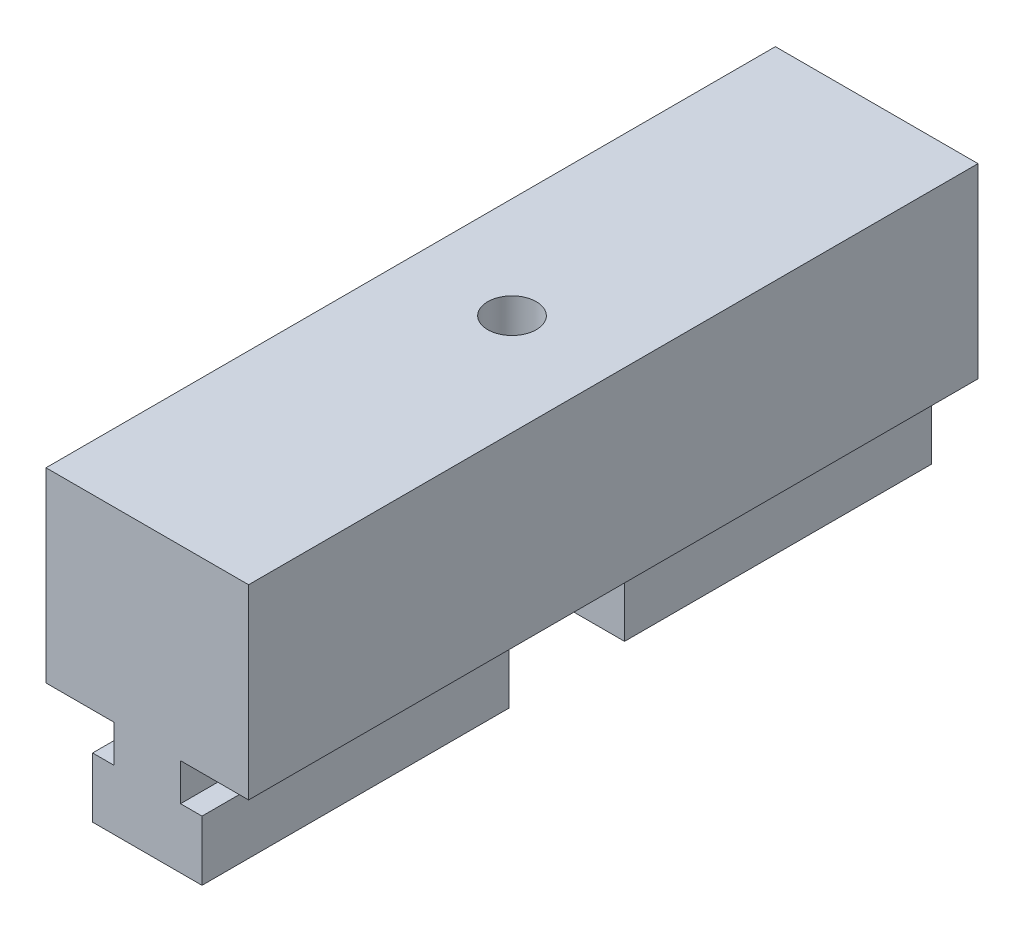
ISO-10303-21;
HEADER;
FILE_DESCRIPTION(('STEP AP214'),'2;1');
FILE_NAME('part.step','',(''),(''),'','','');
FILE_SCHEMA(('AUTOMOTIVE_DESIGN { 1 0 10303 214 1 1 1 1 }'));
ENDSEC;
DATA;
#1=APPLICATION_CONTEXT('core data for automotive mechanical design processes');
#2=APPLICATION_PROTOCOL_DEFINITION('international standard','automotive_design',2000,#1);
#3=PRODUCT_CONTEXT('',#1,'mechanical');
#4=PRODUCT('Part','Part','',(#3));
#5=PRODUCT_RELATED_PRODUCT_CATEGORY('part','',(#4));
#6=PRODUCT_DEFINITION_FORMATION('','',#4);
#7=PRODUCT_DEFINITION_CONTEXT('part definition',#1,'design');
#8=PRODUCT_DEFINITION('design','',#6,#7);
#9=PRODUCT_DEFINITION_SHAPE('','',#8);
#10=(LENGTH_UNIT() NAMED_UNIT(*) SI_UNIT(.MILLI.,.METRE.));
#11=(NAMED_UNIT(*) PLANE_ANGLE_UNIT() SI_UNIT($,.RADIAN.));
#12=(NAMED_UNIT(*) SI_UNIT($,.STERADIAN.) SOLID_ANGLE_UNIT());
#13=UNCERTAINTY_MEASURE_WITH_UNIT(LENGTH_MEASURE(1.E-05),#10,'distance_accuracy_value','');
#14=(GEOMETRIC_REPRESENTATION_CONTEXT(3) GLOBAL_UNCERTAINTY_ASSIGNED_CONTEXT((#13)) GLOBAL_UNIT_ASSIGNED_CONTEXT((#10,
#11,#12)) REPRESENTATION_CONTEXT('',''));
#15=CARTESIAN_POINT('',(0.,0.,0.));
#16=DIRECTION('',(0.,0.,1.));
#17=DIRECTION('',(1.,0.,0.));
#18=AXIS2_PLACEMENT_3D('',#15,#16,#17);
#19=CARTESIAN_POINT('',(-4.10000610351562,-4.5999984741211,-45.));
#20=DIRECTION('',(0.,1.,0.));
#21=DIRECTION('',(0.,0.,1.));
#22=AXIS2_PLACEMENT_3D('',#19,#20,#21);
#23=PLANE('',#22);
#24=DIRECTION('',(0.,0.,1.));
#25=VECTOR('',#24,1.);
#26=CARTESIAN_POINT('',(-4.10000610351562,-4.5999984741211,-45.));
#27=LINE('',#26,#25);
#28=CARTESIAN_POINT('',(-4.10000610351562,-4.5999984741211,7.1375));
#29=VERTEX_POINT('',#28);
#30=CARTESIAN_POINT('',(-4.10000610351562,-4.5999984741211,45.));
#31=VERTEX_POINT('',#30);
#32=EDGE_CURVE('E282',#29,#31,#27,.T.);
#33=ORIENTED_EDGE('',*,*,#32,.F.);
#34=DIRECTION('',(-1.,0.,0.));
#35=VECTOR('',#34,1.);
#36=CARTESIAN_POINT('',(-4.10000610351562,-4.5999984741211,7.1375));
#37=LINE('',#36,#35);
#38=CARTESIAN_POINT('',(-6.75,-4.5999984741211,7.1375));
#39=VERTEX_POINT('',#38);
#40=EDGE_CURVE('E353',#29,#39,#37,.T.);
#41=ORIENTED_EDGE('',*,*,#40,.T.);
#42=DIRECTION('',(0.,0.,1.));
#43=VECTOR('',#42,1.);
#44=CARTESIAN_POINT('',(-6.75,-4.5999984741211,-45.));
#45=LINE('',#44,#43);
#46=CARTESIAN_POINT('',(-6.75,-4.5999984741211,45.));
#47=VERTEX_POINT('',#46);
#48=EDGE_CURVE('E197',#39,#47,#45,.T.);
#49=ORIENTED_EDGE('',*,*,#48,.T.);
#50=DIRECTION('',(-1.,0.,0.));
#51=VECTOR('',#50,1.);
#52=CARTESIAN_POINT('',(-4.10000610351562,-4.5999984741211,45.));
#53=LINE('',#52,#51);
#54=EDGE_CURVE('E222',#31,#47,#53,.T.);
#55=ORIENTED_EDGE('',*,*,#54,.F.);
#56=EDGE_LOOP('',(#33,#41,#49,#55));
#57=FACE_BOUND('',#56,.T.);
#58=ADVANCED_FACE('F32',(#57),#23,.T.);
#59=CARTESIAN_POINT('',(-4.10000610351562,0.,-45.));
#60=DIRECTION('',(-1.,0.,0.));
#61=DIRECTION('',(0.,0.,1.));
#62=AXIS2_PLACEMENT_3D('',#59,#60,#61);
#63=PLANE('',#62);
#64=DIRECTION('',(0.,0.,1.));
#65=VECTOR('',#64,1.);
#66=CARTESIAN_POINT('',(-4.10000610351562,-4.38000000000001,-45.));
#67=LINE('',#66,#65);
#68=CARTESIAN_POINT('',(-4.10000610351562,-4.38000000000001,-7.1375));
#69=VERTEX_POINT('',#68);
#70=CARTESIAN_POINT('',(-4.10000610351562,-4.38000000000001,7.1375));
#71=VERTEX_POINT('',#70);
#72=EDGE_CURVE('E352',#69,#71,#67,.T.);
#73=ORIENTED_EDGE('',*,*,#72,.T.);
#74=DIRECTION('',(0.,-1.,0.));
#75=VECTOR('',#74,1.);
#76=CARTESIAN_POINT('',(-4.10000610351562,0.,7.1375));
#77=LINE('',#76,#75);
#78=EDGE_CURVE('E357',#71,#29,#77,.T.);
#79=ORIENTED_EDGE('',*,*,#78,.T.);
#80=ORIENTED_EDGE('',*,*,#32,.T.);
#81=DIRECTION('',(0.,-1.,0.));
#82=VECTOR('',#81,1.);
#83=CARTESIAN_POINT('',(-4.10000610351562,0.,45.));
#84=LINE('',#83,#82);
#85=CARTESIAN_POINT('',(-4.10000610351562,0.,45.));
#86=VERTEX_POINT('',#85);
#87=EDGE_CURVE('E246',#86,#31,#84,.T.);
#88=ORIENTED_EDGE('',*,*,#87,.F.);
#89=DIRECTION('',(0.,0.,1.));
#90=VECTOR('',#89,1.);
#91=CARTESIAN_POINT('',(-4.10000610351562,0.,-45.));
#92=LINE('',#91,#90);
#93=CARTESIAN_POINT('',(-4.10000610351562,0.,-45.));
#94=VERTEX_POINT('',#93);
#95=EDGE_CURVE('E283',#94,#86,#92,.T.);
#96=ORIENTED_EDGE('',*,*,#95,.F.);
#97=DIRECTION('',(0.,-1.,0.));
#98=VECTOR('',#97,1.);
#99=CARTESIAN_POINT('',(-4.10000610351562,0.,-45.));
#100=LINE('',#99,#98);
#101=CARTESIAN_POINT('',(-4.10000610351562,-4.5999984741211,-45.));
#102=VERTEX_POINT('',#101);
#103=EDGE_CURVE('E278',#94,#102,#100,.T.);
#104=ORIENTED_EDGE('',*,*,#103,.T.);
#105=CARTESIAN_POINT('',(-4.10000610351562,-4.5999984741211,-7.1375));
#106=VERTEX_POINT('',#105);
#107=EDGE_CURVE('E54',#102,#106,#27,.T.);
#108=ORIENTED_EDGE('',*,*,#107,.T.);
#109=DIRECTION('',(0.,-1.,0.));
#110=VECTOR('',#109,1.);
#111=CARTESIAN_POINT('',(-4.10000610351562,0.,-7.1375));
#112=LINE('',#111,#110);
#113=EDGE_CURVE('E363',#69,#106,#112,.T.);
#114=ORIENTED_EDGE('',*,*,#113,.F.);
#115=EDGE_LOOP('',(#73,#79,#80,#88,#96,#104,#108,#114));
#116=FACE_BOUND('',#115,.T.);
#117=ADVANCED_FACE('F346',(#116),#63,.T.);
#118=CARTESIAN_POINT('',(4.10000610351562,-4.5999984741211,-45.));
#119=DIRECTION('',(1.,0.,0.));
#120=DIRECTION('',(0.,1.,0.));
#121=AXIS2_PLACEMENT_3D('',#118,#119,#120);
#122=PLANE('',#121);
#123=DIRECTION('',(0.,0.,1.));
#124=VECTOR('',#123,1.);
#125=CARTESIAN_POINT('',(4.10000610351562,-4.5999984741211,-45.));
#126=LINE('',#125,#124);
#127=CARTESIAN_POINT('',(4.10000610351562,-4.5999984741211,7.1375));
#128=VERTEX_POINT('',#127);
#129=CARTESIAN_POINT('',(4.10000610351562,-4.5999984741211,45.));
#130=VERTEX_POINT('',#129);
#131=EDGE_CURVE('E297',#128,#130,#126,.T.);
#132=ORIENTED_EDGE('',*,*,#131,.F.);
#133=DIRECTION('',(0.,1.,0.));
#134=VECTOR('',#133,1.);
#135=CARTESIAN_POINT('',(4.10000610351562,-4.5999984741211,7.1375));
#136=LINE('',#135,#134);
#137=CARTESIAN_POINT('',(4.10000610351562,-4.38000000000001,7.1375));
#138=VERTEX_POINT('',#137);
#139=EDGE_CURVE('E319',#128,#138,#136,.T.);
#140=ORIENTED_EDGE('',*,*,#139,.T.);
#141=DIRECTION('',(0.,0.,-1.));
#142=VECTOR('',#141,1.);
#143=CARTESIAN_POINT('',(4.10000610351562,-4.38000000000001,-45.));
#144=LINE('',#143,#142);
#145=CARTESIAN_POINT('',(4.10000610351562,-4.38000000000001,-7.1375));
#146=VERTEX_POINT('',#145);
#147=EDGE_CURVE('E11',#138,#146,#144,.T.);
#148=ORIENTED_EDGE('',*,*,#147,.T.);
#149=DIRECTION('',(0.,1.,0.));
#150=VECTOR('',#149,1.);
#151=CARTESIAN_POINT('',(4.10000610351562,-4.5999984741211,-7.1375));
#152=LINE('',#151,#150);
#153=CARTESIAN_POINT('',(4.10000610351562,-4.5999984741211,-7.1375));
#154=VERTEX_POINT('',#153);
#155=EDGE_CURVE('E365',#154,#146,#152,.T.);
#156=ORIENTED_EDGE('',*,*,#155,.F.);
#157=CARTESIAN_POINT('',(4.10000610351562,-4.5999984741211,-45.));
#158=VERTEX_POINT('',#157);
#159=EDGE_CURVE('E295',#158,#154,#126,.T.);
#160=ORIENTED_EDGE('',*,*,#159,.F.);
#161=DIRECTION('',(0.,1.,0.));
#162=VECTOR('',#161,1.);
#163=CARTESIAN_POINT('',(4.10000610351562,-4.5999984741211,-45.));
#164=LINE('',#163,#162);
#165=CARTESIAN_POINT('',(4.10000610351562,0.,-45.));
#166=VERTEX_POINT('',#165);
#167=EDGE_CURVE('E260',#158,#166,#164,.T.);
#168=ORIENTED_EDGE('',*,*,#167,.T.);
#169=DIRECTION('',(0.,0.,1.));
#170=VECTOR('',#169,1.);
#171=CARTESIAN_POINT('',(4.10000610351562,0.,-45.));
#172=LINE('',#171,#170);
#173=CARTESIAN_POINT('',(4.10000610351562,0.,45.));
#174=VERTEX_POINT('',#173);
#175=EDGE_CURVE('E293',#166,#174,#172,.T.);
#176=ORIENTED_EDGE('',*,*,#175,.T.);
#177=DIRECTION('',(0.,1.,0.));
#178=VECTOR('',#177,1.);
#179=CARTESIAN_POINT('',(4.10000610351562,-4.5999984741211,45.));
#180=LINE('',#179,#178);
#181=EDGE_CURVE('E228',#130,#174,#180,.T.);
#182=ORIENTED_EDGE('',*,*,#181,.F.);
#183=EDGE_LOOP('',(#132,#140,#148,#156,#160,#168,#176,#182));
#184=FACE_BOUND('',#183,.T.);
#185=ADVANCED_FACE('F318',(#184),#122,.T.);
#186=CARTESIAN_POINT('',(6.75,-4.5999984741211,-45.));
#187=DIRECTION('',(0.,1.,0.));
#188=DIRECTION('',(0.,0.,1.));
#189=AXIS2_PLACEMENT_3D('',#186,#187,#188);
#190=PLANE('',#189);
#191=DIRECTION('',(0.,0.,1.));
#192=VECTOR('',#191,1.);
#193=CARTESIAN_POINT('',(6.75,-4.5999984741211,-45.));
#194=LINE('',#193,#192);
#195=CARTESIAN_POINT('',(6.75,-4.5999984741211,7.1375));
#196=VERTEX_POINT('',#195);
#197=CARTESIAN_POINT('',(6.75,-4.5999984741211,45.));
#198=VERTEX_POINT('',#197);
#199=EDGE_CURVE('E300',#196,#198,#194,.T.);
#200=ORIENTED_EDGE('',*,*,#199,.F.);
#201=DIRECTION('',(-1.,0.,0.));
#202=VECTOR('',#201,1.);
#203=CARTESIAN_POINT('',(6.75,-4.5999984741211,7.1375));
#204=LINE('',#203,#202);
#205=EDGE_CURVE('E315',#196,#128,#204,.T.);
#206=ORIENTED_EDGE('',*,*,#205,.T.);
#207=ORIENTED_EDGE('',*,*,#131,.T.);
#208=DIRECTION('',(-1.,0.,0.));
#209=VECTOR('',#208,1.);
#210=CARTESIAN_POINT('',(6.75,-4.5999984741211,45.));
#211=LINE('',#210,#209);
#212=EDGE_CURVE('E220',#198,#130,#211,.T.);
#213=ORIENTED_EDGE('',*,*,#212,.F.);
#214=EDGE_LOOP('',(#200,#206,#207,#213));
#215=FACE_BOUND('',#214,.T.);
#216=ADVANCED_FACE('F313',(#215),#190,.T.);
#217=CARTESIAN_POINT('',(6.75,-12.,-45.));
#218=DIRECTION('',(1.,0.,0.));
#219=DIRECTION('',(0.,0.,-1.));
#220=AXIS2_PLACEMENT_3D('',#217,#218,#219);
#221=PLANE('',#220);
#222=DIRECTION('',(0.,0.,1.));
#223=VECTOR('',#222,1.);
#224=CARTESIAN_POINT('',(6.75,-12.,-45.));
#225=LINE('',#224,#223);
#226=CARTESIAN_POINT('',(6.75,-12.,7.1375));
#227=VERTEX_POINT('',#226);
#228=CARTESIAN_POINT('',(6.75,-12.,45.));
#229=VERTEX_POINT('',#228);
#230=EDGE_CURVE('E190',#227,#229,#225,.T.);
#231=ORIENTED_EDGE('',*,*,#230,.F.);
#232=DIRECTION('',(0.,-1.,0.));
#233=VECTOR('',#232,1.);
#234=CARTESIAN_POINT('',(6.75,-4.38000000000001,7.1375));
#235=LINE('',#234,#233);
#236=EDGE_CURVE('E306',#196,#227,#235,.T.);
#237=ORIENTED_EDGE('',*,*,#236,.F.);
#238=ORIENTED_EDGE('',*,*,#199,.T.);
#239=DIRECTION('',(0.,1.,0.));
#240=VECTOR('',#239,1.);
#241=CARTESIAN_POINT('',(6.75,-12.,45.));
#242=LINE('',#241,#240);
#243=EDGE_CURVE('E217',#229,#198,#242,.T.);
#244=ORIENTED_EDGE('',*,*,#243,.F.);
#245=EDGE_LOOP('',(#231,#237,#238,#244));
#246=FACE_BOUND('',#245,.T.);
#247=ADVANCED_FACE('F305',(#246),#221,.T.);
#248=CARTESIAN_POINT('',(-6.75,-12.,-45.));
#249=DIRECTION('',(0.,-1.,0.));
#250=DIRECTION('',(0.,0.,-1.));
#251=AXIS2_PLACEMENT_3D('',#248,#249,#250);
#252=PLANE('',#251);
#253=DIRECTION('',(0.,0.,1.));
#254=VECTOR('',#253,1.);
#255=CARTESIAN_POINT('',(-6.75,-12.,-45.));
#256=LINE('',#255,#254);
#257=CARTESIAN_POINT('',(-6.75,-12.,7.1375));
#258=VERTEX_POINT('',#257);
#259=CARTESIAN_POINT('',(-6.75,-12.,45.));
#260=VERTEX_POINT('',#259);
#261=EDGE_CURVE('E191',#258,#260,#256,.T.);
#262=ORIENTED_EDGE('',*,*,#261,.F.);
#263=DIRECTION('',(1.,0.,0.));
#264=VECTOR('',#263,1.);
#265=CARTESIAN_POINT('',(-6.75,-12.,7.1375));
#266=LINE('',#265,#264);
#267=EDGE_CURVE('E183',#258,#227,#266,.T.);
#268=ORIENTED_EDGE('',*,*,#267,.T.);
#269=ORIENTED_EDGE('',*,*,#230,.T.);
#270=DIRECTION('',(1.,0.,0.));
#271=VECTOR('',#270,1.);
#272=CARTESIAN_POINT('',(-6.75,-12.,45.));
#273=LINE('',#272,#271);
#274=EDGE_CURVE('E213',#260,#229,#273,.T.);
#275=ORIENTED_EDGE('',*,*,#274,.F.);
#276=EDGE_LOOP('',(#262,#268,#269,#275));
#277=FACE_BOUND('',#276,.T.);
#278=ADVANCED_FACE('F210',(#277),#252,.T.);
#279=CARTESIAN_POINT('',(-6.75,-4.5999984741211,-45.));
#280=DIRECTION('',(-1.,0.,0.));
#281=DIRECTION('',(0.,0.,1.));
#282=AXIS2_PLACEMENT_3D('',#279,#280,#281);
#283=PLANE('',#282);
#284=ORIENTED_EDGE('',*,*,#48,.F.);
#285=DIRECTION('',(0.,-1.,0.));
#286=VECTOR('',#285,1.);
#287=CARTESIAN_POINT('',(-6.75,-4.5999984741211,7.1375));
#288=LINE('',#287,#286);
#289=EDGE_CURVE('E40',#39,#258,#288,.T.);
#290=ORIENTED_EDGE('',*,*,#289,.T.);
#291=ORIENTED_EDGE('',*,*,#261,.T.);
#292=DIRECTION('',(0.,-1.,0.));
#293=VECTOR('',#292,1.);
#294=CARTESIAN_POINT('',(-6.75,-4.5999984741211,45.));
#295=LINE('',#294,#293);
#296=EDGE_CURVE('E218',#47,#260,#295,.T.);
#297=ORIENTED_EDGE('',*,*,#296,.F.);
#298=EDGE_LOOP('',(#284,#290,#291,#297));
#299=FACE_BOUND('',#298,.T.);
#300=ADVANCED_FACE('F202',(#299),#283,.T.);
#301=DIRECTION('',(-1.,0.,0.));
#302=VECTOR('',#301,1.);
#303=CARTESIAN_POINT('',(-4.10000610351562,-4.5999984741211,-7.1375));
#304=LINE('',#303,#302);
#305=CARTESIAN_POINT('',(-6.75,-4.5999984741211,-7.13750000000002));
#306=VERTEX_POINT('',#305);
#307=EDGE_CURVE('E47',#106,#306,#304,.T.);
#308=ORIENTED_EDGE('',*,*,#307,.F.);
#309=ORIENTED_EDGE('',*,*,#107,.F.);
#310=DIRECTION('',(-1.,0.,0.));
#311=VECTOR('',#310,1.);
#312=CARTESIAN_POINT('',(-4.10000610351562,-4.5999984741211,-45.));
#313=LINE('',#312,#311);
#314=CARTESIAN_POINT('',(-6.75,-4.5999984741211,-45.));
#315=VERTEX_POINT('',#314);
#316=EDGE_CURVE('E249',#102,#315,#313,.T.);
#317=ORIENTED_EDGE('',*,*,#316,.T.);
#318=EDGE_CURVE('E194',#315,#306,#45,.T.);
#319=ORIENTED_EDGE('',*,*,#318,.T.);
#320=EDGE_LOOP('',(#308,#309,#317,#319));
#321=FACE_BOUND('',#320,.T.);
#322=ADVANCED_FACE('F34',(#321),#23,.T.);
#323=CARTESIAN_POINT('',(-12.5,0.,-45.));
#324=DIRECTION('',(0.,-1.,0.));
#325=DIRECTION('',(1.,0.,0.));
#326=AXIS2_PLACEMENT_3D('',#323,#324,#325);
#327=PLANE('',#326);
#328=ORIENTED_EDGE('',*,*,#95,.T.);
#329=DIRECTION('',(1.,0.,0.));
#330=VECTOR('',#329,1.);
#331=CARTESIAN_POINT('',(-12.5,0.,45.));
#332=LINE('',#331,#330);
#333=CARTESIAN_POINT('',(-12.5,0.,45.));
#334=VERTEX_POINT('',#333);
#335=EDGE_CURVE('E243',#334,#86,#332,.T.);
#336=ORIENTED_EDGE('',*,*,#335,.F.);
#337=DIRECTION('',(0.,0.,1.));
#338=VECTOR('',#337,1.);
#339=CARTESIAN_POINT('',(-12.5,0.,-45.));
#340=LINE('',#339,#338);
#341=CARTESIAN_POINT('',(-12.5,0.,-45.));
#342=VERTEX_POINT('',#341);
#343=EDGE_CURVE('E285',#342,#334,#340,.T.);
#344=ORIENTED_EDGE('',*,*,#343,.F.);
#345=DIRECTION('',(1.,0.,0.));
#346=VECTOR('',#345,1.);
#347=CARTESIAN_POINT('',(-12.5,0.,-45.));
#348=LINE('',#347,#346);
#349=EDGE_CURVE('E275',#342,#94,#348,.T.);
#350=ORIENTED_EDGE('',*,*,#349,.T.);
#351=EDGE_LOOP('',(#328,#336,#344,#350));
#352=FACE_BOUND('',#351,.T.);
#353=ADVANCED_FACE('F342',(#352),#327,.T.);
#354=CARTESIAN_POINT('',(-12.5,22.9999923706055,-45.));
#355=DIRECTION('',(-1.,0.,0.));
#356=DIRECTION('',(0.,-1.,0.));
#357=AXIS2_PLACEMENT_3D('',#354,#355,#356);
#358=PLANE('',#357);
#359=ORIENTED_EDGE('',*,*,#343,.T.);
#360=DIRECTION('',(0.,-1.,0.));
#361=VECTOR('',#360,1.);
#362=CARTESIAN_POINT('',(-12.5,22.9999923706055,45.));
#363=LINE('',#362,#361);
#364=CARTESIAN_POINT('',(-12.5,22.9999923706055,45.));
#365=VERTEX_POINT('',#364);
#366=EDGE_CURVE('E240',#365,#334,#363,.T.);
#367=ORIENTED_EDGE('',*,*,#366,.F.);
#368=DIRECTION('',(0.,0.,1.));
#369=VECTOR('',#368,1.);
#370=CARTESIAN_POINT('',(-12.5,22.9999923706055,-45.));
#371=LINE('',#370,#369);
#372=CARTESIAN_POINT('',(-12.5,22.9999923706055,-45.));
#373=VERTEX_POINT('',#372);
#374=EDGE_CURVE('E287',#373,#365,#371,.T.);
#375=ORIENTED_EDGE('',*,*,#374,.F.);
#376=DIRECTION('',(0.,-1.,0.));
#377=VECTOR('',#376,1.);
#378=CARTESIAN_POINT('',(-12.5,22.9999923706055,-45.));
#379=LINE('',#378,#377);
#380=EDGE_CURVE('E272',#373,#342,#379,.T.);
#381=ORIENTED_EDGE('',*,*,#380,.T.);
#382=EDGE_LOOP('',(#359,#367,#375,#381));
#383=FACE_BOUND('',#382,.T.);
#384=ADVANCED_FACE('F340',(#383),#358,.T.);
#385=CARTESIAN_POINT('',(12.5,22.9999923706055,-45.));
#386=DIRECTION('',(0.,1.,0.));
#387=DIRECTION('',(0.,0.,1.));
#388=AXIS2_PLACEMENT_3D('',#385,#386,#387);
#389=PLANE('',#388);
#390=CARTESIAN_POINT('',(0.,22.9999923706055,0.));
#391=DIRECTION('',(0.,-1.,0.));
#392=DIRECTION('',(0.,0.,-1.));
#393=AXIS2_PLACEMENT_3D('',#390,#391,#392);
#394=CIRCLE('',#393,3.);
#395=CARTESIAN_POINT('',(0.,22.9999923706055,-3.));
#396=VERTEX_POINT('',#395);
#397=EDGE_CURVE('E184',#396,#396,#394,.T.);
#398=ORIENTED_EDGE('',*,*,#397,.T.);
#399=EDGE_LOOP('',(#398));
#400=FACE_BOUND('',#399,.T.);
#401=ORIENTED_EDGE('',*,*,#374,.T.);
#402=DIRECTION('',(-1.,0.,0.));
#403=VECTOR('',#402,1.);
#404=CARTESIAN_POINT('',(12.5,22.9999923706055,45.));
#405=LINE('',#404,#403);
#406=CARTESIAN_POINT('',(12.5,22.9999923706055,45.));
#407=VERTEX_POINT('',#406);
#408=EDGE_CURVE('E237',#407,#365,#405,.T.);
#409=ORIENTED_EDGE('',*,*,#408,.F.);
#410=DIRECTION('',(0.,0.,1.));
#411=VECTOR('',#410,1.);
#412=CARTESIAN_POINT('',(12.5,22.9999923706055,-45.));
#413=LINE('',#412,#411);
#414=CARTESIAN_POINT('',(12.5,22.9999923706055,-45.));
#415=VERTEX_POINT('',#414);
#416=EDGE_CURVE('E289',#415,#407,#413,.T.);
#417=ORIENTED_EDGE('',*,*,#416,.F.);
#418=DIRECTION('',(-1.,0.,0.));
#419=VECTOR('',#418,1.);
#420=CARTESIAN_POINT('',(12.5,22.9999923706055,-45.));
#421=LINE('',#420,#419);
#422=EDGE_CURVE('E269',#415,#373,#421,.T.);
#423=ORIENTED_EDGE('',*,*,#422,.T.);
#424=EDGE_LOOP('',(#401,#409,#417,#423));
#425=FACE_BOUND('',#424,.T.);
#426=ADVANCED_FACE('F335',(#400,#425),#389,.T.);
#427=CARTESIAN_POINT('',(12.5,0.,-45.));
#428=DIRECTION('',(1.,0.,0.));
#429=DIRECTION('',(0.,0.,-1.));
#430=AXIS2_PLACEMENT_3D('',#427,#428,#429);
#431=PLANE('',#430);
#432=ORIENTED_EDGE('',*,*,#416,.T.);
#433=DIRECTION('',(0.,1.,0.));
#434=VECTOR('',#433,1.);
#435=CARTESIAN_POINT('',(12.5,0.,45.));
#436=LINE('',#435,#434);
#437=CARTESIAN_POINT('',(12.5,0.,45.));
#438=VERTEX_POINT('',#437);
#439=EDGE_CURVE('E234',#438,#407,#436,.T.);
#440=ORIENTED_EDGE('',*,*,#439,.F.);
#441=DIRECTION('',(0.,0.,1.));
#442=VECTOR('',#441,1.);
#443=CARTESIAN_POINT('',(12.5,0.,-45.));
#444=LINE('',#443,#442);
#445=CARTESIAN_POINT('',(12.5,0.,-45.));
#446=VERTEX_POINT('',#445);
#447=EDGE_CURVE('E291',#446,#438,#444,.T.);
#448=ORIENTED_EDGE('',*,*,#447,.F.);
#449=DIRECTION('',(0.,1.,0.));
#450=VECTOR('',#449,1.);
#451=CARTESIAN_POINT('',(12.5,0.,-45.));
#452=LINE('',#451,#450);
#453=EDGE_CURVE('E266',#446,#415,#452,.T.);
#454=ORIENTED_EDGE('',*,*,#453,.T.);
#455=EDGE_LOOP('',(#432,#440,#448,#454));
#456=FACE_BOUND('',#455,.T.);
#457=ADVANCED_FACE('F327',(#456),#431,.T.);
#458=CARTESIAN_POINT('',(4.10000610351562,0.,-45.));
#459=DIRECTION('',(0.,-1.,0.));
#460=DIRECTION('',(1.,0.,0.));
#461=AXIS2_PLACEMENT_3D('',#458,#459,#460);
#462=PLANE('',#461);
#463=ORIENTED_EDGE('',*,*,#447,.T.);
#464=DIRECTION('',(1.,0.,0.));
#465=VECTOR('',#464,1.);
#466=CARTESIAN_POINT('',(4.10000610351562,0.,45.));
#467=LINE('',#466,#465);
#468=EDGE_CURVE('E231',#174,#438,#467,.T.);
#469=ORIENTED_EDGE('',*,*,#468,.F.);
#470=ORIENTED_EDGE('',*,*,#175,.F.);
#471=DIRECTION('',(1.,0.,0.));
#472=VECTOR('',#471,1.);
#473=CARTESIAN_POINT('',(4.10000610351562,0.,-45.));
#474=LINE('',#473,#472);
#475=EDGE_CURVE('E263',#166,#446,#474,.T.);
#476=ORIENTED_EDGE('',*,*,#475,.T.);
#477=EDGE_LOOP('',(#463,#469,#470,#476));
#478=FACE_BOUND('',#477,.T.);
#479=ADVANCED_FACE('F323',(#478),#462,.T.);
#480=DIRECTION('',(-1.,0.,0.));
#481=VECTOR('',#480,1.);
#482=CARTESIAN_POINT('',(6.75,-4.5999984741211,-7.1375));
#483=LINE('',#482,#481);
#484=CARTESIAN_POINT('',(6.75,-4.5999984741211,-7.1375));
#485=VERTEX_POINT('',#484);
#486=EDGE_CURVE('E367',#485,#154,#483,.T.);
#487=ORIENTED_EDGE('',*,*,#486,.F.);
#488=CARTESIAN_POINT('',(6.75,-4.5999984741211,-45.));
#489=VERTEX_POINT('',#488);
#490=EDGE_CURVE('E298',#489,#485,#194,.T.);
#491=ORIENTED_EDGE('',*,*,#490,.F.);
#492=DIRECTION('',(-1.,0.,0.));
#493=VECTOR('',#492,1.);
#494=CARTESIAN_POINT('',(6.75,-4.5999984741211,-45.));
#495=LINE('',#494,#493);
#496=EDGE_CURVE('E257',#489,#158,#495,.T.);
#497=ORIENTED_EDGE('',*,*,#496,.T.);
#498=ORIENTED_EDGE('',*,*,#159,.T.);
#499=EDGE_LOOP('',(#487,#491,#497,#498));
#500=FACE_BOUND('',#499,.T.);
#501=ADVANCED_FACE('F401',(#500),#190,.T.);
#502=DIRECTION('',(0.,-1.,0.));
#503=VECTOR('',#502,1.);
#504=CARTESIAN_POINT('',(6.75,-4.38000000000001,-7.1375));
#505=LINE('',#504,#503);
#506=CARTESIAN_POINT('',(6.75,-12.,-7.1375));
#507=VERTEX_POINT('',#506);
#508=EDGE_CURVE('E369',#485,#507,#505,.T.);
#509=ORIENTED_EDGE('',*,*,#508,.T.);
#510=CARTESIAN_POINT('',(6.75,-12.,-45.));
#511=VERTEX_POINT('',#510);
#512=EDGE_CURVE('E182',#511,#507,#225,.T.);
#513=ORIENTED_EDGE('',*,*,#512,.F.);
#514=DIRECTION('',(0.,1.,0.));
#515=VECTOR('',#514,1.);
#516=CARTESIAN_POINT('',(6.75,-12.,-45.));
#517=LINE('',#516,#515);
#518=EDGE_CURVE('E254',#511,#489,#517,.T.);
#519=ORIENTED_EDGE('',*,*,#518,.T.);
#520=ORIENTED_EDGE('',*,*,#490,.T.);
#521=EDGE_LOOP('',(#509,#513,#519,#520));
#522=FACE_BOUND('',#521,.T.);
#523=ADVANCED_FACE('F404',(#522),#221,.T.);
#524=DIRECTION('',(1.,0.,0.));
#525=VECTOR('',#524,1.);
#526=CARTESIAN_POINT('',(-6.75,-12.,-7.1375));
#527=LINE('',#526,#525);
#528=CARTESIAN_POINT('',(-6.75,-12.,-7.1375));
#529=VERTEX_POINT('',#528);
#530=EDGE_CURVE('E170',#529,#507,#527,.T.);
#531=ORIENTED_EDGE('',*,*,#530,.F.);
#532=CARTESIAN_POINT('',(-6.75,-12.,-45.));
#533=VERTEX_POINT('',#532);
#534=EDGE_CURVE('E180',#533,#529,#256,.T.);
#535=ORIENTED_EDGE('',*,*,#534,.F.);
#536=DIRECTION('',(1.,0.,0.));
#537=VECTOR('',#536,1.);
#538=CARTESIAN_POINT('',(-6.75,-12.,-45.));
#539=LINE('',#538,#537);
#540=EDGE_CURVE('E252',#533,#511,#539,.T.);
#541=ORIENTED_EDGE('',*,*,#540,.T.);
#542=ORIENTED_EDGE('',*,*,#512,.T.);
#543=EDGE_LOOP('',(#531,#535,#541,#542));
#544=FACE_BOUND('',#543,.T.);
#545=ADVANCED_FACE('F178',(#544),#252,.T.);
#546=DIRECTION('',(0.,-1.,0.));
#547=VECTOR('',#546,1.);
#548=CARTESIAN_POINT('',(-6.75,-4.5999984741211,-7.1375));
#549=LINE('',#548,#547);
#550=EDGE_CURVE('E167',#306,#529,#549,.T.);
#551=ORIENTED_EDGE('',*,*,#550,.F.);
#552=ORIENTED_EDGE('',*,*,#318,.F.);
#553=DIRECTION('',(0.,-1.,0.));
#554=VECTOR('',#553,1.);
#555=CARTESIAN_POINT('',(-6.75,-4.5999984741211,-45.));
#556=LINE('',#555,#554);
#557=EDGE_CURVE('E189',#315,#533,#556,.T.);
#558=ORIENTED_EDGE('',*,*,#557,.T.);
#559=ORIENTED_EDGE('',*,*,#534,.T.);
#560=EDGE_LOOP('',(#551,#552,#558,#559));
#561=FACE_BOUND('',#560,.T.);
#562=ADVANCED_FACE('F187',(#561),#283,.T.);
#563=CARTESIAN_POINT('',(-6.75,-4.5999984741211,-45.));
#564=DIRECTION('',(0.,0.,1.));
#565=DIRECTION('',(1.,0.,0.));
#566=AXIS2_PLACEMENT_3D('',#563,#564,#565);
#567=PLANE('',#566);
#568=ORIENTED_EDGE('',*,*,#316,.F.);
#569=ORIENTED_EDGE('',*,*,#103,.F.);
#570=ORIENTED_EDGE('',*,*,#349,.F.);
#571=ORIENTED_EDGE('',*,*,#380,.F.);
#572=ORIENTED_EDGE('',*,*,#422,.F.);
#573=ORIENTED_EDGE('',*,*,#453,.F.);
#574=ORIENTED_EDGE('',*,*,#475,.F.);
#575=ORIENTED_EDGE('',*,*,#167,.F.);
#576=ORIENTED_EDGE('',*,*,#496,.F.);
#577=ORIENTED_EDGE('',*,*,#518,.F.);
#578=ORIENTED_EDGE('',*,*,#540,.F.);
#579=ORIENTED_EDGE('',*,*,#557,.F.);
#580=EDGE_LOOP('',(#568,#569,#570,#571,#572,#573,#574,#575,#576,#577,#578,#579));
#581=FACE_BOUND('',#580,.T.);
#582=ADVANCED_FACE('F330',(#581),#567,.F.);
#583=CARTESIAN_POINT('',(-6.75,-4.5999984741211,45.));
#584=DIRECTION('',(0.,0.,1.));
#585=DIRECTION('',(1.,0.,0.));
#586=AXIS2_PLACEMENT_3D('',#583,#584,#585);
#587=PLANE('',#586);
#588=ORIENTED_EDGE('',*,*,#54,.T.);
#589=ORIENTED_EDGE('',*,*,#296,.T.);
#590=ORIENTED_EDGE('',*,*,#274,.T.);
#591=ORIENTED_EDGE('',*,*,#243,.T.);
#592=ORIENTED_EDGE('',*,*,#212,.T.);
#593=ORIENTED_EDGE('',*,*,#181,.T.);
#594=ORIENTED_EDGE('',*,*,#468,.T.);
#595=ORIENTED_EDGE('',*,*,#439,.T.);
#596=ORIENTED_EDGE('',*,*,#408,.T.);
#597=ORIENTED_EDGE('',*,*,#366,.T.);
#598=ORIENTED_EDGE('',*,*,#335,.T.);
#599=ORIENTED_EDGE('',*,*,#87,.T.);
#600=EDGE_LOOP('',(#588,#589,#590,#591,#592,#593,#594,#595,#596,#597,#598,#599));
#601=FACE_BOUND('',#600,.T.);
#602=ADVANCED_FACE('F311',(#601),#587,.T.);
#603=CARTESIAN_POINT('',(-6.75,-4.38000000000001,7.1375));
#604=DIRECTION('',(0.,0.,-1.));
#605=DIRECTION('',(-1.,0.,0.));
#606=AXIS2_PLACEMENT_3D('',#603,#604,#605);
#607=PLANE('',#606);
#608=ORIENTED_EDGE('',*,*,#78,.F.);
#609=DIRECTION('',(1.,0.,0.));
#610=VECTOR('',#609,1.);
#611=CARTESIAN_POINT('',(-6.75,-4.38000000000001,7.1375));
#612=LINE('',#611,#610);
#613=EDGE_CURVE('E371',#71,#138,#612,.T.);
#614=ORIENTED_EDGE('',*,*,#613,.T.);
#615=ORIENTED_EDGE('',*,*,#139,.F.);
#616=ORIENTED_EDGE('',*,*,#205,.F.);
#617=ORIENTED_EDGE('',*,*,#236,.T.);
#618=ORIENTED_EDGE('',*,*,#267,.F.);
#619=ORIENTED_EDGE('',*,*,#289,.F.);
#620=ORIENTED_EDGE('',*,*,#40,.F.);
#621=EDGE_LOOP('',(#608,#614,#615,#616,#617,#618,#619,#620));
#622=FACE_BOUND('',#621,.T.);
#623=ADVANCED_FACE('F436',(#622),#607,.T.);
#624=CARTESIAN_POINT('',(-6.75,-4.38000000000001,-7.1375));
#625=DIRECTION('',(0.,0.,-1.));
#626=DIRECTION('',(-1.,0.,0.));
#627=AXIS2_PLACEMENT_3D('',#624,#625,#626);
#628=PLANE('',#627);
#629=ORIENTED_EDGE('',*,*,#307,.T.);
#630=ORIENTED_EDGE('',*,*,#550,.T.);
#631=ORIENTED_EDGE('',*,*,#530,.T.);
#632=ORIENTED_EDGE('',*,*,#508,.F.);
#633=ORIENTED_EDGE('',*,*,#486,.T.);
#634=ORIENTED_EDGE('',*,*,#155,.T.);
#635=DIRECTION('',(1.,0.,0.));
#636=VECTOR('',#635,1.);
#637=CARTESIAN_POINT('',(-6.75,-4.38000000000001,-7.1375));
#638=LINE('',#637,#636);
#639=EDGE_CURVE('E373',#69,#146,#638,.T.);
#640=ORIENTED_EDGE('',*,*,#639,.F.);
#641=ORIENTED_EDGE('',*,*,#113,.T.);
#642=EDGE_LOOP('',(#629,#630,#631,#632,#633,#634,#640,#641));
#643=FACE_BOUND('',#642,.T.);
#644=ADVANCED_FACE('F169',(#643),#628,.F.);
#645=CARTESIAN_POINT('',(-6.75,-4.38000000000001,-7.1375));
#646=DIRECTION('',(0.,-1.,0.));
#647=DIRECTION('',(1.,0.,0.));
#648=AXIS2_PLACEMENT_3D('',#645,#646,#647);
#649=PLANE('',#648);
#650=CARTESIAN_POINT('',(0.,-4.38000000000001,0.));
#651=DIRECTION('',(0.,-1.,0.));
#652=DIRECTION('',(0.,0.,-1.));
#653=AXIS2_PLACEMENT_3D('',#650,#651,#652);
#654=CIRCLE('',#653,3.);
#655=CARTESIAN_POINT('',(0.,-4.38000000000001,-3.));
#656=VERTEX_POINT('',#655);
#657=EDGE_CURVE('E379',#656,#656,#654,.T.);
#658=ORIENTED_EDGE('',*,*,#657,.F.);
#659=EDGE_LOOP('',(#658));
#660=FACE_BOUND('',#659,.T.);
#661=ORIENTED_EDGE('',*,*,#639,.T.);
#662=ORIENTED_EDGE('',*,*,#147,.F.);
#663=ORIENTED_EDGE('',*,*,#613,.F.);
#664=ORIENTED_EDGE('',*,*,#72,.F.);
#665=EDGE_LOOP('',(#661,#662,#663,#664));
#666=FACE_BOUND('',#665,.T.);
#667=ADVANCED_FACE('F389',(#660,#666),#649,.T.);
#668=CARTESIAN_POINT('',(0.,22.9999923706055,0.));
#669=DIRECTION('',(0.,-1.,0.));
#670=DIRECTION('',(0.,0.,-1.));
#671=AXIS2_PLACEMENT_3D('',#668,#669,#670);
#672=CYLINDRICAL_SURFACE('',#671,3.);
#673=ORIENTED_EDGE('',*,*,#397,.F.);
#674=EDGE_LOOP('',(#673));
#675=FACE_BOUND('',#674,.T.);
#676=ORIENTED_EDGE('',*,*,#657,.T.);
#677=EDGE_LOOP('',(#676));
#678=FACE_BOUND('',#677,.T.);
#679=ADVANCED_FACE('F386',(#675,#678),#672,.F.);
#680=CLOSED_SHELL('',(#58,#117,#185,#216,#247,#278,#300,#322,#353,#384,#426,#457,#479,#501,#523,
#545,#562,#582,#602,#623,#644,#667,#679));
#681=MANIFOLD_SOLID_BREP('B2',#680);
#682=ADVANCED_BREP_SHAPE_REPRESENTATION('',(#18,#681),#14);
#683=SHAPE_DEFINITION_REPRESENTATION(#9,#682);
ENDSEC;
END-ISO-10303-21;
